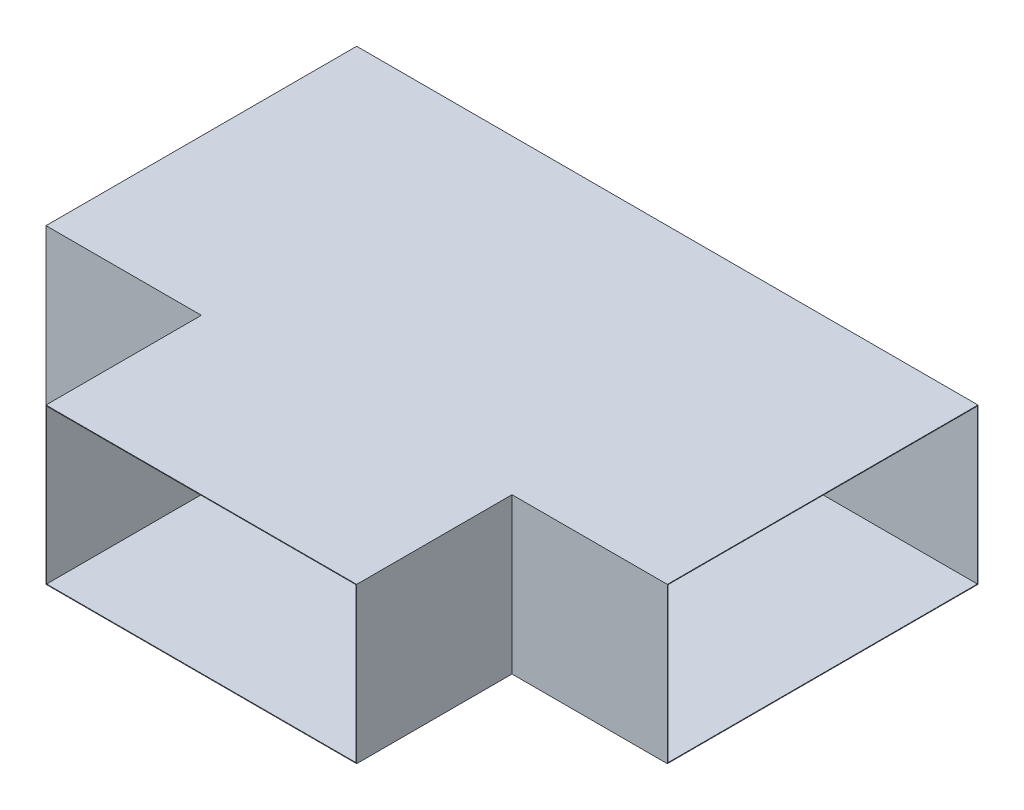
from build123d import *

# Parameters (mm, degrees)
SKETCH1_W           = 1000
SKETCH1_H           = 500
SKETCH1_W_2         = 996
SKETCH1_H_2         = 496
EXTRUDE_THIN1_DEPTH = 1000
SKETCH2_W           = 1000
SKETCH2_H           = 500
SKETCH2_W_2         = 996
SKETCH2_H_2         = 496
EXTRUDE_THIN2_DEPTH = 500
CUT_EXTRUDE1_REACH  = 2063.553
SKETCH3_W           = 996
SKETCH3_H           = 496


with BuildPart() as part:
    # Sketch1 → Extrude-Thin1 (new, symmetric)
    with BuildSketch(Plane(origin=(0, 0, 0), x_dir=(0, 0, -1), z_dir=(1, 0, 0))):
        Rectangle(SKETCH1_W, SKETCH1_H)
        Rectangle(SKETCH1_W_2, SKETCH1_H_2, mode=Mode.SUBTRACT)
    extrude(amount=EXTRUDE_THIN1_DEPTH, both=True)

    # Sketch2 → Extrude-Thin2 (add)
    with BuildSketch(Plane(origin=(0, -250, 500), x_dir=(1, 0, 0), z_dir=(0, 0, -1))):
        with Locations((0, -250)):
            Rectangle(SKETCH2_W, SKETCH2_H)
        with Locations((0, -250)):
            Rectangle(SKETCH2_W_2, SKETCH2_H_2, mode=Mode.SUBTRACT)
    extrude(amount=-EXTRUDE_THIN2_DEPTH)

    # Sketch3 → Cut-Extrude1 (cut, up to next)
    with BuildSketch(Plane(origin=(0, -750, 1000), x_dir=(1, 0, 0), z_dir=(0, 0, -1)), mode=Mode.PRIVATE) as cut_extrude1_sk1:
        with Locations((0, -750)):
            Rectangle(SKETCH3_W, SKETCH3_H)
    cut_extrude1_tool1 = extrude(cut_extrude1_sk1.sketch, amount=CUT_EXTRUDE1_REACH, mode=Mode.PRIVATE) & part.part
    add(cut_extrude1_tool1.solids().sort_by_distance((0, 0, 1000))[0], mode=Mode.SUBTRACT)


solid = part.part
